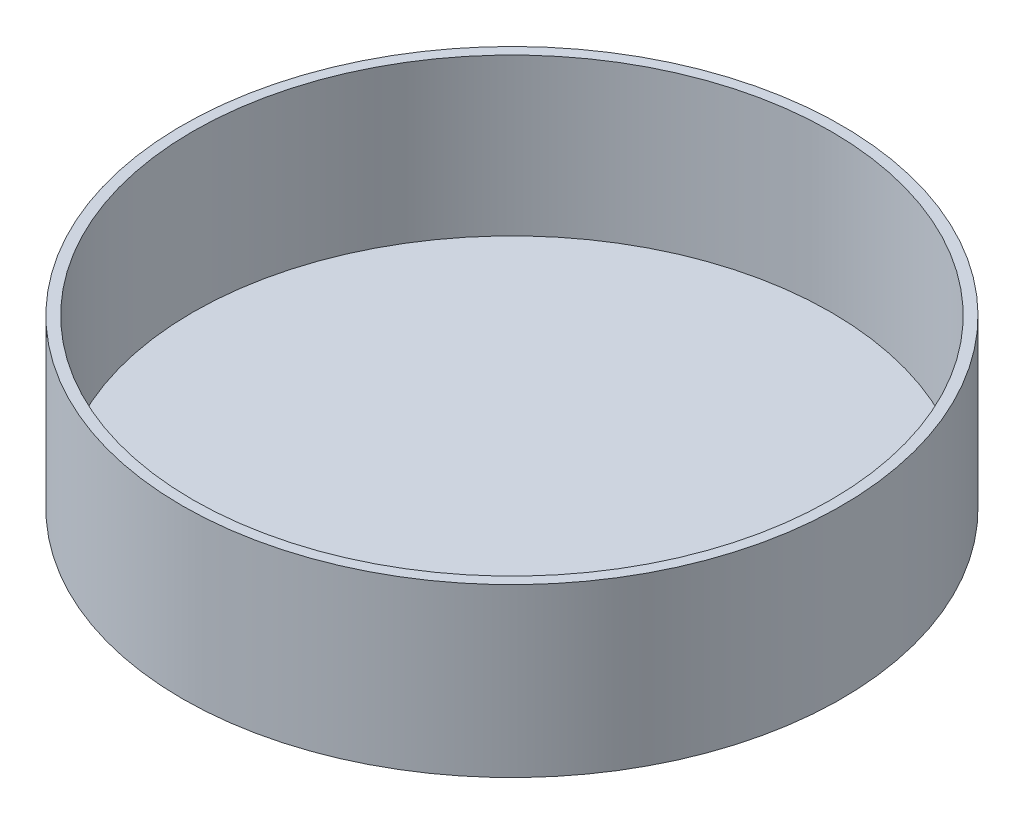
ISO-10303-21;
HEADER;
FILE_DESCRIPTION(('STEP AP214'),'2;1');
FILE_NAME('part.step','',(''),(''),'','','');
FILE_SCHEMA(('AUTOMOTIVE_DESIGN { 1 0 10303 214 1 1 1 1 }'));
ENDSEC;
DATA;
#1=APPLICATION_CONTEXT('core data for automotive mechanical design processes');
#2=APPLICATION_PROTOCOL_DEFINITION('international standard','automotive_design',2000,#1);
#3=PRODUCT_CONTEXT('',#1,'mechanical');
#4=PRODUCT('Part','Part','',(#3));
#5=PRODUCT_RELATED_PRODUCT_CATEGORY('part','',(#4));
#6=PRODUCT_DEFINITION_FORMATION('','',#4);
#7=PRODUCT_DEFINITION_CONTEXT('part definition',#1,'design');
#8=PRODUCT_DEFINITION('design','',#6,#7);
#9=PRODUCT_DEFINITION_SHAPE('','',#8);
#10=(LENGTH_UNIT() NAMED_UNIT(*) SI_UNIT(.MILLI.,.METRE.));
#11=(NAMED_UNIT(*) PLANE_ANGLE_UNIT() SI_UNIT($,.RADIAN.));
#12=(NAMED_UNIT(*) SI_UNIT($,.STERADIAN.) SOLID_ANGLE_UNIT());
#13=UNCERTAINTY_MEASURE_WITH_UNIT(LENGTH_MEASURE(1.E-05),#10,'distance_accuracy_value','');
#14=(GEOMETRIC_REPRESENTATION_CONTEXT(3) GLOBAL_UNCERTAINTY_ASSIGNED_CONTEXT((#13)) GLOBAL_UNIT_ASSIGNED_CONTEXT((#10,
#11,#12)) REPRESENTATION_CONTEXT('',''));
#15=CARTESIAN_POINT('',(0.,0.,0.));
#16=DIRECTION('',(0.,0.,1.));
#17=DIRECTION('',(1.,0.,0.));
#18=AXIS2_PLACEMENT_3D('',#15,#16,#17);
#19=CARTESIAN_POINT('',(0.,0.85,0.));
#20=DIRECTION('',(0.,-1.,0.));
#21=DIRECTION('',(0.,0.,-1.));
#22=AXIS2_PLACEMENT_3D('',#19,#20,#21);
#23=CYLINDRICAL_SURFACE('',#22,26.765);
#24=CARTESIAN_POINT('',(0.,0.,0.));
#25=DIRECTION('',(0.,1.,0.));
#26=DIRECTION('',(0.,0.,1.));
#27=AXIS2_PLACEMENT_3D('',#24,#25,#26);
#28=CIRCLE('',#27,26.765);
#29=CARTESIAN_POINT('',(0.,0.,26.765));
#30=VERTEX_POINT('',#29);
#31=EDGE_CURVE('E34',#30,#30,#28,.T.);
#32=ORIENTED_EDGE('',*,*,#31,.T.);
#33=EDGE_LOOP('',(#32));
#34=FACE_BOUND('',#33,.T.);
#35=CARTESIAN_POINT('',(0.,13.57,0.));
#36=DIRECTION('',(0.,1.,0.));
#37=DIRECTION('',(0.,0.,1.));
#38=AXIS2_PLACEMENT_3D('',#35,#36,#37);
#39=CIRCLE('',#38,26.765);
#40=CARTESIAN_POINT('',(0.,13.57,26.765));
#41=VERTEX_POINT('',#40);
#42=EDGE_CURVE('E38',#41,#41,#39,.T.);
#43=ORIENTED_EDGE('',*,*,#42,.F.);
#44=EDGE_LOOP('',(#43));
#45=FACE_BOUND('',#44,.T.);
#46=ADVANCED_FACE('F28',(#34,#45),#23,.T.);
#47=CARTESIAN_POINT('',(0.,0.,0.));
#48=DIRECTION('',(0.,1.,0.));
#49=DIRECTION('',(0.,0.,1.));
#50=AXIS2_PLACEMENT_3D('',#47,#48,#49);
#51=PLANE('',#50);
#52=ORIENTED_EDGE('',*,*,#31,.F.);
#53=EDGE_LOOP('',(#52));
#54=FACE_BOUND('',#53,.T.);
#55=ADVANCED_FACE('F52',(#54),#51,.F.);
#56=CARTESIAN_POINT('',(0.,13.57,0.));
#57=DIRECTION('',(0.,1.,0.));
#58=DIRECTION('',(0.,0.,1.));
#59=AXIS2_PLACEMENT_3D('',#56,#57,#58);
#60=PLANE('',#59);
#61=ORIENTED_EDGE('',*,*,#42,.T.);
#62=EDGE_LOOP('',(#61));
#63=FACE_BOUND('',#62,.T.);
#64=CARTESIAN_POINT('',(0.,13.57,0.));
#65=DIRECTION('',(0.,1.,0.));
#66=DIRECTION('',(0.,0.,1.));
#67=AXIS2_PLACEMENT_3D('',#64,#65,#66);
#68=CIRCLE('',#67,25.915);
#69=CARTESIAN_POINT('',(0.,13.57,-25.915));
#70=VERTEX_POINT('',#69);
#71=EDGE_CURVE('E42',#70,#70,#68,.T.);
#72=ORIENTED_EDGE('',*,*,#71,.F.);
#73=EDGE_LOOP('',(#72));
#74=FACE_BOUND('',#73,.T.);
#75=ADVANCED_FACE('F50',(#63,#74),#60,.T.);
#76=CARTESIAN_POINT('',(0.,13.57,0.));
#77=DIRECTION('',(0.,-1.,0.));
#78=DIRECTION('',(0.,0.,-1.));
#79=AXIS2_PLACEMENT_3D('',#76,#77,#78);
#80=CYLINDRICAL_SURFACE('',#79,25.915);
#81=CARTESIAN_POINT('',(0.,0.85,0.));
#82=DIRECTION('',(0.,1.,0.));
#83=DIRECTION('',(0.,0.,1.));
#84=AXIS2_PLACEMENT_3D('',#81,#82,#83);
#85=CIRCLE('',#84,25.915);
#86=CARTESIAN_POINT('',(0.,0.85,-25.915));
#87=VERTEX_POINT('',#86);
#88=EDGE_CURVE('E10',#87,#87,#85,.F.);
#89=CARTESIAN_POINT('',(0.,13.57,-25.915));
#90=CARTESIAN_POINT('',(0.,13.4375,-25.915));
#91=CARTESIAN_POINT('',(0.,13.305,-25.915));
#92=CARTESIAN_POINT('',(0.,13.04,-25.915));
#93=CARTESIAN_POINT('',(0.,12.9075,-25.915));
#94=CARTESIAN_POINT('',(0.,12.6425,-25.915));
#95=CARTESIAN_POINT('',(0.,12.51,-25.915));
#96=CARTESIAN_POINT('',(0.,12.245,-25.915));
#97=CARTESIAN_POINT('',(0.,12.1125,-25.915));
#98=CARTESIAN_POINT('',(0.,11.8475,-25.915));
#99=CARTESIAN_POINT('',(0.,11.715,-25.915));
#100=CARTESIAN_POINT('',(0.,11.45,-25.915));
#101=CARTESIAN_POINT('',(0.,11.3175,-25.915));
#102=CARTESIAN_POINT('',(0.,11.0525,-25.915));
#103=CARTESIAN_POINT('',(0.,10.92,-25.915));
#104=CARTESIAN_POINT('',(0.,10.655,-25.915));
#105=CARTESIAN_POINT('',(0.,10.5225,-25.915));
#106=CARTESIAN_POINT('',(0.,10.2575,-25.915));
#107=CARTESIAN_POINT('',(0.,10.125,-25.915));
#108=CARTESIAN_POINT('',(0.,9.86,-25.915));
#109=CARTESIAN_POINT('',(0.,9.7275,-25.915));
#110=CARTESIAN_POINT('',(0.,9.4625,-25.915));
#111=CARTESIAN_POINT('',(0.,9.33,-25.915));
#112=CARTESIAN_POINT('',(0.,9.065,-25.915));
#113=CARTESIAN_POINT('',(0.,8.9325,-25.915));
#114=CARTESIAN_POINT('',(0.,8.6675,-25.915));
#115=CARTESIAN_POINT('',(0.,8.535,-25.915));
#116=CARTESIAN_POINT('',(0.,8.27,-25.915));
#117=CARTESIAN_POINT('',(0.,8.1375,-25.915));
#118=CARTESIAN_POINT('',(0.,7.8725,-25.915));
#119=CARTESIAN_POINT('',(0.,7.74,-25.915));
#120=CARTESIAN_POINT('',(0.,7.475,-25.915));
#121=CARTESIAN_POINT('',(0.,7.3425,-25.915));
#122=CARTESIAN_POINT('',(0.,7.0775,-25.915));
#123=CARTESIAN_POINT('',(0.,6.945,-25.915));
#124=CARTESIAN_POINT('',(0.,6.68,-25.915));
#125=CARTESIAN_POINT('',(0.,6.5475,-25.915));
#126=CARTESIAN_POINT('',(0.,6.2825,-25.915));
#127=CARTESIAN_POINT('',(0.,6.15,-25.915));
#128=CARTESIAN_POINT('',(0.,5.885,-25.915));
#129=CARTESIAN_POINT('',(0.,5.7525,-25.915));
#130=CARTESIAN_POINT('',(0.,5.4875,-25.915));
#131=CARTESIAN_POINT('',(0.,5.355,-25.915));
#132=CARTESIAN_POINT('',(0.,5.09,-25.915));
#133=CARTESIAN_POINT('',(0.,4.9575,-25.915));
#134=CARTESIAN_POINT('',(0.,4.6925,-25.915));
#135=CARTESIAN_POINT('',(0.,4.56,-25.915));
#136=CARTESIAN_POINT('',(0.,4.295,-25.915));
#137=CARTESIAN_POINT('',(0.,4.1625,-25.915));
#138=CARTESIAN_POINT('',(0.,3.8975,-25.915));
#139=CARTESIAN_POINT('',(0.,3.765,-25.915));
#140=CARTESIAN_POINT('',(0.,3.5,-25.915));
#141=CARTESIAN_POINT('',(0.,3.3675,-25.915));
#142=CARTESIAN_POINT('',(0.,3.1025,-25.915));
#143=CARTESIAN_POINT('',(0.,2.97,-25.915));
#144=CARTESIAN_POINT('',(0.,2.705,-25.915));
#145=CARTESIAN_POINT('',(0.,2.5725,-25.915));
#146=CARTESIAN_POINT('',(0.,2.3075,-25.915));
#147=CARTESIAN_POINT('',(0.,2.175,-25.915));
#148=CARTESIAN_POINT('',(0.,1.91,-25.915));
#149=CARTESIAN_POINT('',(0.,1.7775,-25.915));
#150=CARTESIAN_POINT('',(0.,1.5125,-25.915));
#151=CARTESIAN_POINT('',(0.,1.38,-25.915));
#152=CARTESIAN_POINT('',(0.,1.115,-25.915));
#153=CARTESIAN_POINT('',(0.,0.9825,-25.915));
#154=CARTESIAN_POINT('',(0.,0.85,-25.915));
#155=B_SPLINE_CURVE_WITH_KNOTS('',3,(#89,#90,#91,#92,#93,#94,#95,#96,#97,#98,#99,#100,#101,#102,
#103,#104,#105,#106,#107,#108,#109,#110,#111,#112,#113,#114,#115,#116,#117,#118,#119,#120,#121,
#122,#123,#124,#125,#126,#127,#128,#129,#130,#131,#132,#133,#134,#135,#136,#137,#138,#139,#140,
#141,#142,#143,#144,#145,#146,#147,#148,#149,#150,#151,#152,#153,#154),.UNSPECIFIED.,.F.,.F.,(4,
2,2,2,2,2,2,2,2,2,2,2,2,2,2,2,2,2,2,2,2,2,2,2,2,2,2,2,2,2,2,2,4),(0.,0.3975,0.795000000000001,
1.1925,1.59,1.9875,2.385,2.7825,3.18,3.5775,3.975,4.3725,4.77,5.1675,5.565,5.9625,6.36,6.7575,
7.155,7.5525,7.95,8.3475,8.745,9.1425,9.54,9.9375,10.335,10.7325,11.13,11.5275,11.925,12.3225,
12.72),.UNSPECIFIED.);
#156=EDGE_CURVE('BSEAM48',#70,#87,#155,.T.);
#157=ORIENTED_EDGE('',*,*,#71,.T.);
#158=ORIENTED_EDGE('',*,*,#88,.T.);
#159=ORIENTED_EDGE('',*,*,#156,.T.);
#160=ORIENTED_EDGE('',*,*,#156,.F.);
#161=EDGE_LOOP('',(#157,#159,#158,#160));
#162=FACE_BOUND('',#161,.T.);
#163=ADVANCED_FACE('F48',(#162),#80,.F.);
#164=CARTESIAN_POINT('',(0.,0.85,0.));
#165=DIRECTION('',(0.,1.,0.));
#166=DIRECTION('',(0.,0.,1.));
#167=AXIS2_PLACEMENT_3D('',#164,#165,#166);
#168=PLANE('',#167);
#169=ORIENTED_EDGE('',*,*,#88,.F.);
#170=EDGE_LOOP('',(#169));
#171=FACE_BOUND('',#170,.T.);
#172=ADVANCED_FACE('F59',(#171),#168,.T.);
#173=CLOSED_SHELL('',(#46,#55,#75,#163,#172));
#174=MANIFOLD_SOLID_BREP('B2',#173);
#175=ADVANCED_BREP_SHAPE_REPRESENTATION('',(#18,#174),#14);
#176=SHAPE_DEFINITION_REPRESENTATION(#9,#175);
ENDSEC;
END-ISO-10303-21;
